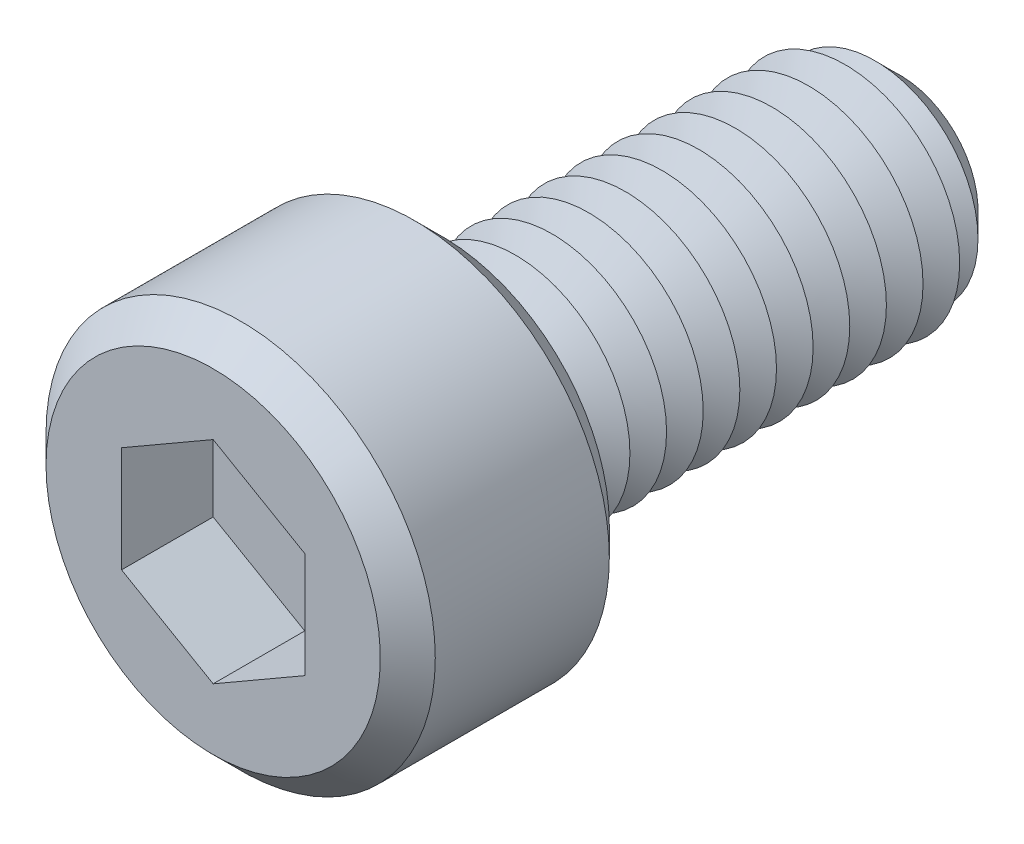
from build123d import *

# Parameters (mm, degrees)
SKETCH1_R           = 4.25
BOSS_EXTRUDE1_DEPTH = 5
SKETCH2_R           = 2.5
BOSS_EXTRUDE2_DEPTH = 10
CHAMFER1_SIZE       = 0.8
LPATTERN1_COUNT     = 12
LPATTERN1_PITCH     = 0.8
CUT_EXTRUDE1_DEPTH  = 2
SKETCH6_R           = 0.65
CUT_EXTRUDE2_DEPTH  = 13
CHAMFER2_SIZE       = 0.6


with BuildPart() as part:
    # Sketch1 → Boss-Extrude1 (new body)
    with BuildSketch(Plane.XY):
        Circle(SKETCH1_R)
    extrude(amount=BOSS_EXTRUDE1_DEPTH)

    # Sketch2 → Boss-Extrude2 (add)
    with BuildSketch(Plane(origin=(0, 0, 0), x_dir=(-1, 0, 0), z_dir=(0, 0, -1))):
        Circle(SKETCH2_R)
    extrude(amount=BOSS_EXTRUDE2_DEPTH)

    # Chamfer1
    chamfer1_edges = [part.edges().sort_by_distance(p)[0] for p in [
        (2.5, 0, -10),
    ]]
    chamfer(chamfer1_edges, length=CHAMFER1_SIZE)

    # Sketch4 → Cut-Revolve1 (revolve, cut)
    with BuildSketch(Plane(origin=(0, 0, 0), x_dir=(0, 0, -1), z_dir=(1, 0, 0)), mode=Mode.PRIVATE) as cut_revolve1_sk:
        Polygon((0, 2.5), (0.4, 1.807179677), (0.8, 2.5), align=None)
    cut_revolve1 = revolve(cut_revolve1_sk.sketch.rotate(Axis((0, 0, 2.512122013), (0, 0, -1)), 90), axis=Axis((0, 0, 2.512122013), (0, 0, -1)), mode=Mode.SUBTRACT)

    # LPattern1: Cut-Revolve1 ×12
    with Locations(*[(0, 0, -i * LPATTERN1_PITCH) for i in range(1, LPATTERN1_COUNT)]):
        add(cut_revolve1, mode=Mode.SUBTRACT)

    # Sketch5 → Cut-Extrude1 (cut)
    with BuildSketch(Plane.XY.offset(5)):
        Polygon((0, 2.309401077), (-2, 1.154700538), (-2, -1.154700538), (0, -2.309401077), (2, -1.154700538), (2, 1.154700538), align=None)
    extrude(amount=-CUT_EXTRUDE1_DEPTH, mode=Mode.SUBTRACT)

    # Sketch6 → Cut-Extrude2 (cut)
    with BuildSketch(Plane.XY.offset(3)):
        Circle(SKETCH6_R)
    extrude(amount=-CUT_EXTRUDE2_DEPTH, mode=Mode.SUBTRACT)

    # Chamfer2
    chamfer2_edges = [part.edges().sort_by_distance(p)[0] for p in [
        (-4.25, 0, 0),
        (-4.25, 0, 5),
    ]]
    chamfer(chamfer2_edges, length=CHAMFER2_SIZE)


solid = part.part
